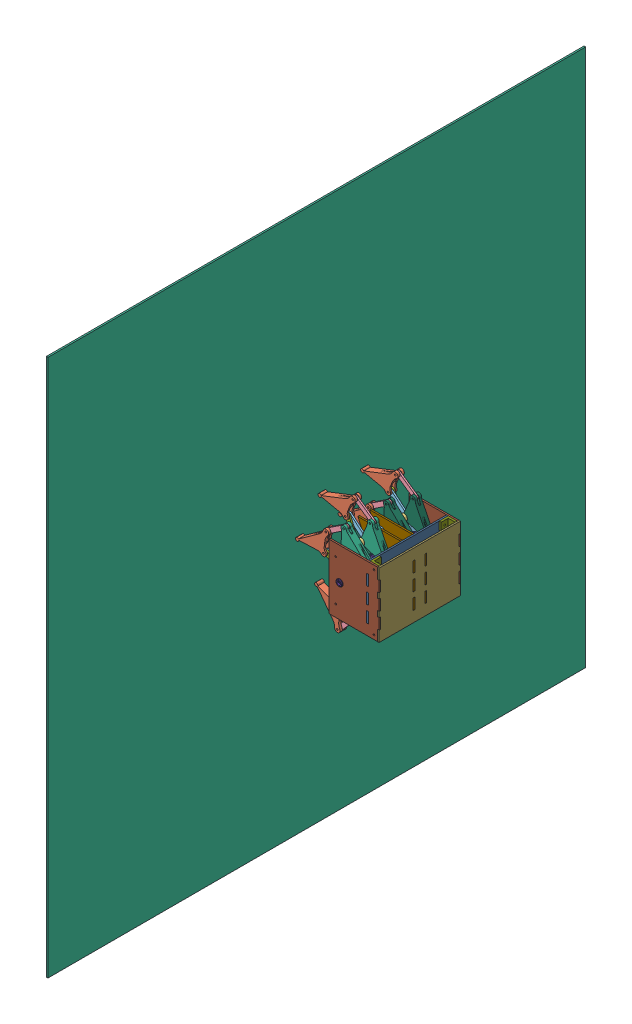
SolidWorks assembly Assemblage marcheur.SLDASM, configuration Défaut (file format 15000). Lengths in mm.
Overall size (169.95 218.78 155.6).
76 component instances, 24 part files, 188 mates.
Components (placement in the parent):
- tt motor-1: tt motor.SLDPRT [Défaut] at (-73 -18.3419 79.6) x (0.906308 0.422618 0) z (0 0 1) size (22.5 70.2 36.8)
- piece triengle bas-pied imp-1: piece triengle bas-pied imp.SLDPRT [Défaut] at (-97.5738 79.1089 85.8) x (0.931902 0.362711 0) z (0 0 1) size (73.7 37.03 12)
- piece vilbrequin 1 imp-1: piece vilbrequin 1 imp.SLDPRT [Défaut] at (-73 -18.3419 88.6) x (-0.413136 -0.910669 0) z (0 0 -1) size (12 27 23.4)
- piece jambe intertriengle 1 decoupe 3mm-1: piece jambe intertriengle 1 decoupe 3mm.SLDPRT [Défaut] at (-65.2336 56.6039 90.3) x (0.820817 -0.571192 0) z (0 0 1) size (47.4 8 3)
- piece jambe intertriengle 2 decoupe 3mm-1: piece jambe intertriengle 2 decoupe 3mm.SLDPRT [Défaut] at (-80.8 19.6581 88.7) x (0.766103 -0.642717 0) z (0 0 1) size (47.3 8 3)
- piece triengle haut imp-1: piece triengle haut imp.SLDPRT [Défaut] at (-40.3341 6.6675 85.8) x (0.95214 -0.305662 0) z (0 0 1) size (52.5 49.94 12)
- piece jambe vilbrequin bas decoupe 3mm-1: piece jambe vilbrequin bas decoupe 3mm.SLDPRT [Défaut] at (-86.66 -12.1449 91.9) x (0.391094 -0.920351 0) z (0 0 1) size (73.5 15 3)
- piece jambe vilbrequin haut decoupe 3mm-1: piece jambe vilbrequin haut decoupe 3mm.SLDPRT [Défaut] at (-86.66 -12.1449 88.8) x (-0.92652 -0.376246 0) z (0 0 1) size (61.5 15 3)
- piece chassie decoupe 3mm-1: piece chassie decoupe 3mm.SLDPRT [Défaut] at (0 -18.3419 60.8) x (0 1 0) z (0 0 -1) size (120 103 3)
- piece chassie decoupe 3mm-2: piece chassie decoupe 3mm.SLDPRT [Défaut] at (0 -18.3419 82.6) x (0 1 0) z (0 0 -1) size (120 103 3)
- piece dessou decoupe 3mm-1: piece dessou decoupe 3mm.SLDPRT [Défaut] at (-20 -18.3419 -5.6) x (0 1 0) z (-1 0 0) size (120 151.6 3)
- piece flac decoupe 3mm-1: piece flac decoupe 3mm.SLDPRT [Défaut] at (0 -18.3419 -5.6) x (0 -1 0) z (0 0 1) size (120 93 3)
- piece flac decoupe 3mm-2: piece flac decoupe 3mm.SLDPRT [Défaut] at (0 -18.3419 143) x (0 -1 0) z (0 0 1) size (120 93 3)
- piece dessus decoupe 3mm-1: piece dessus decoupe 3mm.SLDPRT [Défaut] at (-3 -18.3419 -2.6) x (0 -1 0) z (1 0 0) size (120 151.6 3)
- piece vilbrequin 1 imp-2: piece vilbrequin 1 imp.SLDPRT [Défaut] at (-73 -18.3419 51.8) x (-0.413136 -0.910669 0) z (0 0 1) size (12 27 23.4)
- piece vilbrequin 2 imp-1: piece vilbrequin 2 imp.SLDPRT [Défaut] at (-59.34 -24.5389 45.3) x (0.351809 -0.936072 0) z (0 0 -1) size (15 36.24 27)
- piece vilbrequin 2 imp-2: piece vilbrequin 2 imp.SLDPRT [Défaut] at (-79.2221 -32.0114 27.3) x (-0.936072 -0.351809 0) z (0 0 -1) size (15 36.24 27)
- piece vilbrequin 3 imp-1: piece vilbrequin 3 imp.SLDPRT [Défaut] at (-86.6945 -12.1292 9.3) x (0.351809 -0.936072 0) z (0 0 -1) size (25.61 25.61 14.9)
- piece vilbrequin 2 imp-5: piece vilbrequin 2 imp.SLDPRT [Défaut] at (-86.66 -12.1449 95.1) x (-0.936072 -0.351809 0) z (0 0 1) size (15 36.24 27)
- piece vilbrequin 2 imp-6: piece vilbrequin 2 imp.SLDPRT [Défaut] at (-79.1876 -32.027 113.1) x (0.351809 -0.936072 0) z (0 0 1) size (15 36.24 27)
- piece vilbrequin 3 imp-3: piece vilbrequin 3 imp.SLDPRT [Défaut] at (-59.3055 -24.5546 131.1) x (-0.936072 -0.351809 0) z (0 0 1) size (25.61 25.61 14.9)
- piece jambe vilbrequin bas decoupe 3mm-5: piece jambe vilbrequin bas decoupe 3mm.SLDPRT [Défaut] at (-79.1876 -32.027 106.7) x (0.351073 0.936348 0) z (0 0 1) size (73.5 15 3)
- piece jambe vilbrequin haut decoupe 3mm-5: piece jambe vilbrequin haut decoupe 3mm.SLDPRT [Défaut] at (-79.1876 -32.027 109.9) x (-0.812188 0.583395 0) z (0 0 1) size (61.5 15 3)
- piece triengle haut imp-5: piece triengle haut imp.SLDPRT [Défaut] at (-38.5782 -61.1968 115.9) x (0.993454 -0.114233 0) z (0 0 -1) size (52.5 49.94 12)
- piece jambe intertriengle 2 decoupe 3mm-5: piece jambe intertriengle 2 decoupe 3mm.SLDPRT [Défaut] at (-80.8 -56.3419 109.9) x (0.512829 0.858491 0) z (0 0 1) size (47.3 8 3)
- piece jambe intertriengle 1 decoupe 3mm-5: piece jambe intertriengle 1 decoupe 3mm.SLDPRT [Défaut] at (-81.8566 -96.4192 108.4) x (0.656076 0.754694 0) z (0 0 1) size (47.4 8 3)
- piece triengle bas-pied imp-5: piece triengle bas-pied imp.SLDPRT [Défaut] at (-107.706 -126.1542 115.9) x (0.599404 -0.800446 0) z (0 0 -1) size (73.7 37.03 12)
- piece jambe vilbrequin haut decoupe 3mm-6: piece jambe vilbrequin haut decoupe 3mm.SLDPRT [Défaut] at (-59.3055 -24.5546 124.8) x (-0.419788 -0.907622 0) z (0 0 1) size (61.5 15 3)
- piece jambe vilbrequin bas decoupe 3mm-6: piece jambe vilbrequin bas decoupe 3mm.SLDPRT [Défaut] at (-59.3055 -24.5546 127.9) x (0.908084 -0.418787 0) z (0 0 1) size (73.5 15 3)
- piece triengle haut imp-6: piece triengle haut imp.SLDPRT [Défaut] at (-38.3161 20.8265 121.8) x (0.999622 0.027492 0) z (0 0 1) size (52.5 49.94 12)
- piece jambe intertriengle 2 decoupe 3mm-6: piece jambe intertriengle 2 decoupe 3mm.SLDPRT [Défaut] at (-80.8 19.6581 124.8) x (0.885666 0.464323 0) z (0 0 1) size (47.3 8 3)
- piece jambe intertriengle 1 decoupe 3mm-6: piece jambe intertriengle 1 decoupe 3mm.SLDPRT [Défaut] at (-78.3708 59.6757 126.3) x (0.832392 0.554187 0) z (0 0 1) size (47.4 8 3)
- piece triengle bas-pied imp-6: piece triengle bas-pied imp.SLDPRT [Défaut] at (-111.1671 37.8407 121.9) x (0.812864 0.582454 0) z (0 0 1) size (73.7 37.03 12)
- piece jambe vilbrequin haut decoupe 3mm-7: piece jambe vilbrequin haut decoupe 3mm.SLDPRT [Défaut] at (-59.34 -24.5389 48.6) x (-0.420478 -0.907303 0) z (0 0 1) size (61.5 15 3)
- piece jambe vilbrequin bas decoupe 3mm-7: piece jambe vilbrequin bas decoupe 3mm.SLDPRT [Défaut] at (-59.34 -24.5389 45.5) x (0.907885 -0.419218 0) z (0 0 1) size (73.5 15 3)
- piece jambe intertriengle 2 decoupe 3mm-7: piece jambe intertriengle 2 decoupe 3mm.SLDPRT [Défaut] at (-80.8 19.6581 48.6) x (0.886231 0.463244 0) z (0 0 1) size (47.3 8 3)
- piece jambe intertriengle 1 decoupe 3mm-7: piece jambe intertriengle 1 decoupe 3mm.SLDPRT [Défaut] at (-78.3705 59.6756 47.1) x (0.83312 0.553092 0) z (0 0 1) size (47.4 8 3)
- piece triengle haut 2 imp-1: piece triengle haut 2 imp.SLDPRT [Défaut] at (-38.3161 20.8262 54.6) x (0.999622 0.027484 0) z (0 0 1) size (52.5 49.94 12)
- piece triengle bas-pied imp-7: piece triengle bas-pied imp.SLDPRT [Défaut] at (-111.1955 37.8838 42.6) x (0.812765 0.582592 0) z (0 0 1) size (73.7 37.03 12)
- piece jambe vilbrequin bas decoupe 3mm-8: piece jambe vilbrequin bas decoupe 3mm.SLDPRT [Défaut] at (-79.2221 -32.0114 30.6) x (0.350714 0.936483 0) z (0 0 1) size (73.5 15 3)
- piece jambe vilbrequin haut decoupe 3mm-8: piece jambe vilbrequin haut decoupe 3mm.SLDPRT [Défaut] at (-79.2221 -32.0114 27.5) x (-0.813051 0.582192 0) z (0 0 1) size (61.5 15 3)
- piece triengle haut 2 imp-2: piece triengle haut 2 imp.SLDPRT [Défaut] at (-38.5696 -61.121 24.5) x (0.993658 -0.112448 0) z (0 0 -1) size (52.5 49.94 12)
- piece jambe intertriengle 2 decoupe 3mm-8: piece jambe intertriengle 2 decoupe 3mm.SLDPRT [Défaut] at (-80.8 -56.3419 27.5) x (0.51314 0.858305 0) z (0 0 1) size (47.3 8 3)
- piece jambe intertriengle 1 decoupe 3mm-8: piece jambe intertriengle 1 decoupe 3mm.SLDPRT [Défaut] at (-81.7847 -96.421 28.9) x (0.655835 0.754905 0) z (0 0 1) size (47.4 8 3)
- piece triengle bas-pied imp-8: piece triengle bas-pied imp.SLDPRT [Défaut] at (-107.6245 -126.1643 36.4) x (0.601482 -0.798887 0) z (0 0 -1) size (73.7 37.03 12)
- piece jambe vilbrequin bas decoupe 3mm-9: piece jambe vilbrequin bas decoupe 3mm.SLDPRT [Défaut] at (-86.6945 -12.1292 9.5) x (0.389899 -0.920857 0) z (0 0 1) size (73.5 15 3)
- piece jambe vilbrequin haut decoupe 3mm-9: piece jambe vilbrequin haut decoupe 3mm.SLDPRT [Défaut] at (-86.6945 -12.1292 12.6) x (-0.926961 -0.375158 0) z (0 0 1) size (61.5 15 3)
- piece triengle haut 2 imp-3: piece triengle haut 2 imp.SLDPRT [Défaut] at (-40.3465 6.6287 18.6) x (0.951847 -0.306574 0) z (0 0 1) size (52.5 49.94 12)
- piece jambe intertriengle 1 decoupe 3mm-9: piece jambe intertriengle 1 decoupe 3mm.SLDPRT [Défaut] at (-65.1982 56.589 11.1) x (0.819932 -0.572461 0) z (0 0 1) size (47.4 8 3)
- piece jambe intertriengle 2 decoupe 3mm-9: piece jambe intertriengle 2 decoupe 3mm.SLDPRT [Défaut] at (-80.8 19.6581 12.6) x (0.765097 -0.643915 0) z (0 0 1) size (47.3 8 3)
- piece triengle bas-pied imp-9: piece triengle bas-pied imp.SLDPRT [Défaut] at (-97.5036 79.144 6.6) x (0.932227 0.361874 0) z (0 0 1) size (73.7 37.03 12)
- piece equerre imp-1: piece equerre imp.SLDPRT [Défaut] at (-20 -63.3419 -2.6) x (1 0 0) z (0 -1 0) size (17 17 15)
- piece rondelle vilbrequin imp-1: piece rondelle vilbrequin imp.SLDPRT [Défaut] at (-73 -18.3419 146) x (0.97894 -0.204148 0) z (0 0 1) size (12 12 2)
- piece equerre imp-2: piece equerre imp.SLDPRT [Défaut] at (-20 41.6581 -2.6) x (1 0 0) z (0 -1 0) size (17 17 15)
- piece equerre imp-4: piece equerre imp.SLDPRT [Défaut] at (-20 26.6581 143) x (1 0 0) z (0 1 0) size (17 17 15)
- piece equerre imp-5: piece equerre imp.SLDPRT [Défaut] at (-20 -78.3419 143) x (1 0 0) z (0 1 0) size (17 17 15)
- piece rondelle vilbrequin imp-2: piece rondelle vilbrequin imp.SLDPRT [Défaut] at (-73.0345 -18.3262 -5.6) x (0.974065 -0.226269 0) z (0 0 -1) size (12 12 2)
- piece rondelle vilbrequin imp-3: piece rondelle vilbrequin imp.SLDPRT [Défaut] at (-86.6945 -12.1292 0.3) x (0.020392 -0.999792 0) z (0 0 -1) size (12 12 2)
- piece rondelle vilbrequin imp-4: piece rondelle vilbrequin imp.SLDPRT [Défaut] at (-79.2221 -32.0114 18.3) x (-0.903222 -0.429173 0) z (0 0 -1) size (12 12 2)
- piece rondelle vilbrequin imp-5: piece rondelle vilbrequin imp.SLDPRT [Défaut] at (-59.34 -24.5389 36.3) x (-0.670502 -0.741908 0) z (0 0 -1) size (12 12 2)
- piece rondelle vilbrequin imp-6: piece rondelle vilbrequin imp.SLDPRT [Défaut] at (-86.66 -12.1449 104.1) x (0.909029 0.416733 0) z (0 0 1) size (12 12 2)
- piece rondelle vilbrequin imp-7: piece rondelle vilbrequin imp.SLDPRT [Défaut] at (-79.1876 -32.027 122.1) x (0.909029 0.416733 0) z (0 0 1) size (12 12 2)
- piece rondelle vilbrequin imp-8: piece rondelle vilbrequin imp.SLDPRT [Défaut] at (-59.3055 -24.5546 140.1) x (0.909029 0.416733 0) z (0 0 1) size (12 12 2)
- pice entretoise jambe avant 3 imp-1: pice entretoise jambe avant 3 imp.SLDPRT [Défaut] at (-80.8 -56.3419 36.6) x (0.937021 0.349273 0) z (0 0 1) size (12 12 21.1)
- piece entretoise jambe ariere courte imp-1: piece entretoise jambe ariere courte imp.SLDPRT [Défaut] at (-80.8 19.6581 82.7) x (-0.986301 -0.164956 0) z (0 0 1) size (12 12 3)
- piece entretoise jambe ariere imp-1: piece entretoise jambe ariere imp.SLDPRT [Défaut] at (-80.8 -56.3419 116) x (0.337899 0.941183 0) z (0 0 1) size (12 12 26.9)
- piece entretoise jambe avant 1 imp-1: piece entretoise jambe avant 1 imp.SLDPRT [Défaut] at (-80.8 19.6581 98) x (0.948551 -0.316623 0) z (0 0 1) size (12 12 23.7)
- piece entretoise jambe avant 2 imp-1: piece entretoise jambe avant 2 imp.SLDPRT [Défaut] at (-80.8 19.6581 -2.5) x (0.62539 -0.780313 0) z (0 0 1) size (12 12 9)
- piece entretoise moteur imp-1: piece entretoise moteur imp.SLDPRT [Défaut] at (-80.8 -56.3419 60.8) x (-0.784159 -0.62056 0) z (0 0 1) size (12 12 18.8)
- piece entretoise moteur imp-2: piece entretoise moteur imp.SLDPRT [Défaut] at (-80.8 19.6581 60.8) x (0.906308 0.422618 0) z (0 0 1) size (12 12 18.8)
- piece entretoise jambe ariere courte imp-2: piece entretoise jambe ariere courte imp.SLDPRT [Défaut] at (-80.8 19.6581 54.7) x (0.964741 0.2632 0) z (0 0 1) size (12 12 3)
- piece entretoise jambe avant 1 imp-2: piece entretoise jambe avant 1 imp.SLDPRT [Défaut] at (-80.8 19.6581 18.7) x (0.661367 -0.750062 0) z (0 0 1) size (12 12 23.7)
- piece entretoise jambe ariere imp-2: piece entretoise jambe ariere imp.SLDPRT [Défaut] at (-80.8 -56.3419 -2.7) x (0.953597 0.301085 0) z (0 0 1) size (12 12 26.9)
- pice entretoise jambe avant 3 imp-2: pice entretoise jambe avant 3 imp.SLDPRT [Défaut] at (-80.8 -56.3419 82.7) x (0.951721 0.306963 0) z (0 0 1) size (12 12 21.1)
- piece entretoise jambe avant 2 imp-2: piece entretoise jambe avant 2 imp.SLDPRT [Défaut] at (-80.8 19.6581 134) x (0.854045 0.520199 0) z (0 0 1) size (12 12 9)
- plancher des vaches-1: plancher des vaches.SLDPRT [Défaut] at (-167.5 -478.3419 -405.6) x (0 0 1) z (-1 0 0) size (1000 1000 3) (hidden)
Mates (geometry in assembly coordinates):
- Coaxiale1: concentric anti-aligned: circle of tt motor-1; circle of piece vilbrequin 1 imp-1
- Coïncidente1: coincident anti-aligned: plane of tt motor-1 through (-71.0031 -22.6242 80.7) normal (0 0 1); plane of piece vilbrequin 1 imp-1 through (-73 -18.3419 80.7) normal (0 0 -1)
- Coaxiale2: concentric anti-aligned: cylinder of piece vilbrequin 1 imp-1 through (-86.66 -12.1449 95.1) axis (0 0 -1) radius 4.8; circle of piece jambe vilbrequin haut decoupe 3mm-1
- Distance2: distance = 0.2 mm anti-aligned: plane of piece vilbrequin 1 imp-1 through (-73 -18.3419 88.6) normal (0 0 1); plane of piece jambe vilbrequin haut decoupe 3mm-1 through (-86.66 -12.1449 88.8) normal (0 0 -1)
- Coaxiale3: concentric anti-aligned: cylinder of piece vilbrequin 1 imp-1 through (-86.66 -12.1449 95.1) axis (0 0 -1) radius 4.8; circle of piece jambe vilbrequin bas decoupe 3mm-1
- Distance1: distance = 0.1 mm anti-aligned: plane of piece jambe vilbrequin bas decoupe 3mm-1 through (-86.66 -12.1449 91.9) normal (0 0 -1); plane of piece jambe vilbrequin haut decoupe 3mm-1 through (-86.66 -12.1449 91.8) normal (0 0 1)
- Coaxiale14: concentric aligned: cylinder of piece triengle haut imp-1 through (-40.3341 6.6675 97.8) axis (0 0 -1) radius 1.5; cylinder of piece jambe vilbrequin haut decoupe 3mm-1 through (-40.3341 6.6675 91.8) axis (0 0 -1) radius 1.75
- Distance9: distance = 0.1 mm anti-aligned: plane of piece jambe vilbrequin haut decoupe 3mm-1 through (-86.66 -12.1449 91.8) normal (0 0 1); plane of piece triengle haut imp-1 through (-40.3341 6.6675 91.9) normal (0 0 -1)
- Coaxiale15: concentric aligned: cylinder of piece jambe intertriengle 1 decoupe 3mm-1 through (-65.2336 56.6039 93.3) axis (0 0 -1) radius 1.75; cylinder of piece triengle haut imp-1 through (-65.2336 56.6039 97.8) axis (0 0 -1) radius 1.5
- Distance10: distance = 0.1 mm anti-aligned: plane of piece jambe intertriengle 1 decoupe 3mm-1 through (-65.2336 56.6039 90.3) normal (0 0 -1); plane of piece triengle haut imp-1 through (-40.3341 6.6675 90.2) normal (0 0 1)
- Coaxiale16: concentric aligned: cylinder of piece triengle bas-pied imp-1 through (-97.5738 79.1089 97.8) axis (0 0 -1) radius 1.5; cylinder of piece jambe intertriengle 1 decoupe 3mm-1 through (-97.5738 79.1089 93.3) axis (0 0 -1) radius 1.75
- Distance11: distance = 0.1 mm anti-aligned: plane of piece triengle bas-pied imp-1 through (-97.5738 79.1089 90.2) normal (0 0 1); plane of piece jambe intertriengle 1 decoupe 3mm-1 through (-65.2336 56.6039 90.3) normal (0 0 -1)
- Coaxiale17: concentric aligned: cylinder of piece triengle bas-pied imp-1 through (-110.9079 44.9169 97.8) axis (0 0 -1) radius 1.5; cylinder of piece jambe intertriengle 2 decoupe 3mm-1 through (-110.9079 44.9169 91.7) axis (0 0 -1) radius 1.75
- Distance12: distance = 0.1 mm anti-aligned: plane of piece jambe intertriengle 2 decoupe 3mm-1 through (-80.8 19.6581 88.7) normal (0 0 -1); plane of piece triengle bas-pied imp-1 through (-110.9079 44.9169 88.6) normal (0 0 1)
- Coaxiale18: concentric aligned: cylinder of piece jambe intertriengle 2 decoupe 3mm-1 through (-80.8 19.6581 91.7) axis (0 0 -1) radius 1.75; cylinder of piece triengle haut imp-1 through (-80.8 19.6581 97.8) axis (0 0 -1) radius 1.5
- Coaxiale20: concentric aligned: cylinder of piece triengle bas-pied imp-1 through (-110.9079 44.9169 97.8) axis (0 0 -1) radius 1.5; cylinder of piece jambe vilbrequin bas decoupe 3mm-1 through (-110.9079 44.9169 94.9) axis (0 0 -1) radius 1.75
- Coaxiale23: concentric anti-aligned: cylinder of tt motor-1 through (-56.3639 -33.3139 70.2) axis (0 0 -1) radius 1.5; cylinder of piece chassie decoupe 3mm-1 through (-56.3639 -33.3139 57.8) axis (0 0 1) radius 1.5
- Coaxiale24: concentric anti-aligned: cylinder of tt motor-1 through (-72.2243 -40.7097 70.2) axis (0 0 -1) radius 1.5; cylinder of piece chassie decoupe 3mm-1 through (-72.2243 -40.7097 57.8) axis (0 0 1) radius 1.5
- Coïncidente3: coincident anti-aligned: plane of tt motor-1 through (-71.0031 -22.6242 60.8) normal (0 0 -1); plane of piece chassie decoupe 3mm-1 through (0 -18.3419 60.8) normal (0 0 1)
- Coaxiale25: concentric anti-aligned: cylinder of tt motor-1 through (-72.2243 -40.7097 70.2) axis (0 0 -1) radius 1.5; cylinder of piece chassie decoupe 3mm-2 through (-72.2243 -40.7097 79.6) axis (0 0 1) radius 1.5
- Coaxiale26: concentric anti-aligned: cylinder of tt motor-1 through (-56.3639 -33.3139 70.2) axis (0 0 -1) radius 1.5; cylinder of piece chassie decoupe 3mm-2 through (-56.3639 -33.3139 79.6) axis (0 0 1) radius 1.5
- Coïncidente10: coincident anti-aligned: plane of tt motor-1 through (-71.0031 -22.6242 79.6) normal (0 0 1); plane of piece chassie decoupe 3mm-2 through (0 -18.3419 79.6) normal (0 0 -1)
- Coaxiale36: concentric aligned: circle of tt motor-1; circle of piece vilbrequin 1 imp-2
- Coïncidente17: coincident aligned: plane of tt motor-1 through (-73 -18.3419 51.8) normal (0 0 -1); plane of piece vilbrequin 1 imp-2 through (-73 -18.3419 51.8) normal (0 0 -1)
- Coïncidente20: coincident aligned: plane of piece vilbrequin 1 imp-1 through (-8.9232 10.6711 80.7) normal (0.352753 0.935717 0); plane of piece vilbrequin 1 imp-2 through (-4.7386 9.0935 59.7) normal (0.352753 0.935717 0)
- Coaxiale38: concentric aligned: cylinder of piece vilbrequin 1 imp-2 through (-59.34 -24.5389 45.3) axis (0 0 1) radius 4.8; cylinder of piece vilbrequin 2 imp-1 through (-59.34 -24.5389 36.3) axis (0 0 1) radius 7.5
- Parallèle3: parallel anti-aligned: plane of piece vilbrequin 1 imp-2 through (-70.3239 -25.4622 36.3) normal (-0.351809 0.936072 0); plane of piece vilbrequin 2 imp-1 through (-60.4658 -21.5435 36.3) normal (0.351809 -0.936072 0)
- Coïncidente25: coincident anti-aligned: plane of piece vilbrequin 1 imp-2 through (-59.34 -24.5389 45.3) normal (0 0 -1); plane of piece vilbrequin 2 imp-1 through (-59.34 -24.5389 45.3) normal (0 0 1)
- Coaxiale39: concentric aligned: cylinder of piece vilbrequin 2 imp-1 through (-79.2221 -32.0114 27.3) axis (0 0 1) radius 4.75; cylinder of piece vilbrequin 2 imp-2 through (-79.2221 -32.0114 18.3) axis (0 0 1) radius 7.5
- Parallèle4: parallel anti-aligned: plane of piece vilbrequin 2 imp-1 through (-82.0303 -33.0668 18.3) normal (-0.936072 -0.351809 0); plane of piece vilbrequin 2 imp-2 through (-82.2176 -33.1372 18.3) normal (0.936072 0.351809 0)
- Coïncidente27: coincident anti-aligned: plane of piece vilbrequin 2 imp-1 through (-79.2221 -32.0114 27.3) normal (0 0 -1); plane of piece vilbrequin 2 imp-2 through (-79.2221 -32.0114 27.3) normal (0 0 1)
- Coaxiale40: concentric aligned: cylinder of piece vilbrequin 2 imp-2 through (-86.6945 -12.1292 9.3) axis (0 0 1) radius 4.75; cylinder of piece vilbrequin 3 imp-1 through (-86.6945 -12.1292 0.3) axis (0 0 1) radius 5
- Parallèle6: parallel anti-aligned: plane of piece vilbrequin 2 imp-2 through (-85.6391 -14.9374 0.3) normal (0.351809 -0.936072 0); plane of piece vilbrequin 3 imp-1 through (-85.5688 -15.1246 0.3) normal (-0.351809 0.936072 0)
- Coïncidente30: coincident anti-aligned: plane of piece vilbrequin 2 imp-2 through (-86.6945 -12.1292 9.3) normal (0 0 -1); plane of piece vilbrequin 3 imp-1 through (-86.6945 -12.1292 9.3) normal (0 0 1)
- Coaxiale41: concentric aligned: cylinder of piece vilbrequin 1 imp-1 through (-86.66 -12.1449 95.1) axis (0 0 -1) radius 4.8; cylinder of piece vilbrequin 2 imp-5 through (-86.66 -12.1449 104.1) axis (0 0 -1) radius 7.5
- Coïncidente31: coincident anti-aligned: plane of piece vilbrequin 1 imp-1 through (-86.66 -12.1449 95.1) normal (0 0 1); plane of piece vilbrequin 2 imp-5 through (-86.66 -12.1449 95.1) normal (0 0 -1)
- Parallèle7: parallel anti-aligned: plane of piece vilbrequin 1 imp-1 through (-85.7368 -23.1288 104.1) normal (-0.936072 -0.351809 0); plane of piece vilbrequin 2 imp-5 through (-89.6555 -13.2706 104.1) normal (0.936072 0.351809 0)
- Coaxiale42: concentric aligned: cylinder of piece vilbrequin 2 imp-5 through (-79.1876 -32.027 113.1) axis (0 0 -1) radius 4.75; cylinder of piece vilbrequin 2 imp-6 through (-79.1876 -32.027 122.1) axis (0 0 -1) radius 7.5
- Coïncidente33: coincident anti-aligned: plane of piece vilbrequin 2 imp-5 through (-79.1876 -32.027 113.1) normal (0 0 1); plane of piece vilbrequin 2 imp-6 through (-79.1876 -32.027 113.1) normal (0 0 -1)
- Coaxiale50: concentric aligned: cylinder of piece vilbrequin 2 imp-6 through (-59.3055 -24.5546 131.1) axis (0 0 -1) radius 4.75; cylinder of piece vilbrequin 3 imp-3 through (-59.3055 -24.5546 140.1) axis (0 0 -1) radius 7.5
- Parallèle10: parallel anti-aligned: plane of piece vilbrequin 2 imp-5 through (-80.243 -29.2188 122.1) normal (-0.351809 0.936072 0); plane of piece vilbrequin 2 imp-6 through (-80.3134 -29.0316 122.1) normal (0.351809 -0.936072 0)
- Parallèle11: parallel anti-aligned: plane of piece vilbrequin 3 imp-3 through (-62.3009 -25.6804 140.1) normal (0.936072 0.351809 0); plane of piece vilbrequin 2 imp-6 through (-62.1137 -25.61 140.1) normal (-0.936072 -0.351809 0)
- Coïncidente42: coincident anti-aligned: plane of piece vilbrequin 2 imp-6 through (-59.3055 -24.5546 131.1) normal (0 0 1); plane of piece vilbrequin 3 imp-3 through (-59.3055 -24.5546 131.1) normal (0 0 -1)
- Coaxiale51: concentric anti-aligned: cylinder of piece vilbrequin 2 imp-5 through (-79.1876 -32.027 113.1) axis (0 0 -1) radius 4.75; circle of piece jambe vilbrequin bas decoupe 3mm-5
- Coaxiale52: concentric aligned: cylinder of piece vilbrequin 2 imp-5 through (-79.1876 -32.027 113.1) axis (0 0 -1) radius 4.75; cylinder of piece jambe vilbrequin haut decoupe 3mm-5 through (-79.1876 -32.027 112.9) axis (0 0 -1) radius 5
- Distance18: distance = 0.2 mm anti-aligned: plane of piece jambe vilbrequin haut decoupe 3mm-5 through (-79.1876 -32.027 112.9) normal (0 0 1); plane of piece vilbrequin 2 imp-6 through (-79.1876 -32.027 113.1) normal (0 0 -1)
- Distance19: distance = 0.1 mm anti-aligned: plane of piece jambe vilbrequin bas decoupe 3mm-5 through (-79.1876 -32.027 106.7) normal (0 0 -1); plane of piece vilbrequin 2 imp-5 through (-79.1876 -32.027 106.6) normal (0 0 1)
- Coaxiale53: concentric anti-aligned: cylinder of piece jambe vilbrequin haut decoupe 3mm-5 through (-38.5782 -61.1968 112.9) axis (0 0 -1) radius 1.75; cylinder of piece triengle haut imp-5 through (-38.5782 -61.1968 103.9) axis (0 0 1) radius 1.5
- Distance20: distance = 0.1 mm anti-aligned: plane of piece jambe vilbrequin haut decoupe 3mm-5 through (-79.1876 -32.027 109.9) normal (0 0 -1); plane of piece triengle haut imp-5 through (-38.5782 -61.1968 109.8) normal (0 0 1)
- Coaxiale54: concentric anti-aligned: cylinder of piece triengle haut imp-5 through (-80.8 -56.3419 103.9) axis (0 0 1) radius 1.5; cylinder of piece jambe intertriengle 2 decoupe 3mm-5 through (-80.8 -56.3419 112.9) axis (0 0 -1) radius 1.75
- Distance21: distance = 0.1 mm anti-aligned: plane of piece jambe intertriengle 2 decoupe 3mm-5 through (-80.8 -56.3419 109.9) normal (0 0 -1); plane of piece triengle haut imp-5 through (-80.8 -56.3419 109.8) normal (0 0 1)
- Coaxiale55: concentric anti-aligned: cylinder of piece triengle haut imp-5 through (-81.8566 -96.4192 103.9) axis (0 0 1) radius 1.5; cylinder of piece jambe intertriengle 1 decoupe 3mm-5 through (-81.8566 -96.4192 111.4) axis (0 0 -1) radius 1.75
- Distance22: distance = 0.1 mm anti-aligned: plane of piece jambe intertriengle 1 decoupe 3mm-5 through (-81.8566 -96.4192 108.4) normal (0 0 -1); plane of piece triengle haut imp-5 through (-38.5782 -61.1968 108.3) normal (0 0 1)
- Coaxiale57: concentric anti-aligned: cylinder of piece jambe intertriengle 1 decoupe 3mm-5 through (-107.706 -126.1542 111.4) axis (0 0 -1) radius 1.75; cylinder of piece triengle bas-pied imp-5 through (-107.706 -126.1542 103.9) axis (0 0 1) radius 1.5
- Distance23: distance = 0.1 mm anti-aligned: plane of piece triengle bas-pied imp-5 through (-107.706 -126.1542 108.3) normal (0 0 1); plane of piece jambe intertriengle 1 decoupe 3mm-5 through (-81.8566 -96.4192 108.4) normal (0 0 -1)
- Coaxiale58: concentric anti-aligned: cylinder of piece jambe intertriengle 2 decoupe 3mm-5 through (-100.9542 -90.0806 112.9) axis (0 0 -1) radius 1.75; cylinder of piece triengle bas-pied imp-5 through (-100.9542 -90.0806 103.9) axis (0 0 1) radius 1.5
- Coaxiale59: concentric anti-aligned: cylinder of piece jambe vilbrequin bas decoupe 3mm-5 through (-100.9542 -90.0806 109.7) axis (0 0 -1) radius 1.75; cylinder of piece triengle bas-pied imp-5 through (-100.9542 -90.0806 103.9) axis (0 0 1) radius 1.5
- Coïncidente50: coincident aligned: plane of piece vilbrequin 1 imp-1 through (-75.8626 -19.2394 80.7) normal (0.413136 0.910669 0); plane of piece vilbrequin 1 imp-2 through (-71.79 -21.087 59.7) normal (0.413136 0.910669 0)
- Coaxiale60: concentric aligned: cylinder of piece vilbrequin 2 imp-6 through (-59.3055 -24.5546 131.1) axis (0 0 -1) radius 4.75; cylinder of piece jambe vilbrequin bas decoupe 3mm-6 through (-59.3055 -24.5546 130.9) axis (0 0 -1) radius 5
- Distance24: distance = 0.2 mm anti-aligned: plane of piece jambe vilbrequin bas decoupe 3mm-6 through (-59.3055 -24.5546 130.9) normal (0 0 1); plane of piece vilbrequin 3 imp-3 through (-59.3055 -24.5546 131.1) normal (0 0 -1)
- Coaxiale61: concentric aligned: cylinder of piece vilbrequin 2 imp-6 through (-59.3055 -24.5546 131.1) axis (0 0 -1) radius 4.75; cylinder of piece jambe vilbrequin haut decoupe 3mm-6 through (-59.3055 -24.5546 127.8) axis (0 0 -1) radius 5
- Distance25: distance = 0.2 mm anti-aligned: plane of piece jambe vilbrequin haut decoupe 3mm-6 through (-59.3055 -24.5546 124.8) normal (0 0 -1); plane of piece vilbrequin 2 imp-6 through (-59.3055 -24.5546 124.6) normal (0 0 1)
- Coaxiale62: concentric aligned: cylinder of piece jambe vilbrequin haut decoupe 3mm-6 through (-38.3161 20.8265 127.8) axis (0 0 -1) radius 1.75; cylinder of piece triengle haut imp-6 through (-38.3161 20.8265 133.8) axis (0 0 -1) radius 1.5
- Distance26: distance = 0.1 mm anti-aligned: plane of piece jambe vilbrequin haut decoupe 3mm-6 through (-59.3055 -24.5546 124.8) normal (0 0 -1); plane of piece triengle haut imp-6 through (-38.3161 20.8265 124.7) normal (0 0 1)
- Coaxiale63: concentric aligned: cylinder of piece triengle haut imp-6 through (-80.8 19.6581 133.8) axis (0 0 -1) radius 1.5; cylinder of piece jambe intertriengle 2 decoupe 3mm-6 through (-80.8 19.6581 127.8) axis (0 0 -1) radius 1.75
- Distance27: distance = 0.1 mm anti-aligned: plane of piece jambe intertriengle 2 decoupe 3mm-6 through (-80.8 19.6581 127.8) normal (0 0 1); plane of piece triengle haut imp-6 through (-80.8 19.6581 127.9) normal (0 0 -1)
- Coaxiale64: concentric aligned: cylinder of piece triengle haut imp-6 through (-78.3708 59.6757 133.8) axis (0 0 -1) radius 1.5; cylinder of piece jambe intertriengle 1 decoupe 3mm-6 through (-78.3708 59.6757 129.3) axis (0 0 -1) radius 1.75
- Distance28: distance = 0.1 mm anti-aligned: plane of piece jambe intertriengle 1 decoupe 3mm-6 through (-78.3708 59.6757 129.3) normal (0 0 1); plane of piece triengle haut imp-6 through (-38.3161 20.8265 129.4) normal (0 0 -1)
- Coaxiale65: concentric aligned: cylinder of piece jambe intertriengle 2 decoupe 3mm-6 through (-115.6067 1.4102 127.8) axis (0 0 -1) radius 1.75; cylinder of piece triengle bas-pied imp-6 through (-115.6067 1.4102 133.9) axis (0 0 -1) radius 1.5
- Distance29: distance = 0.1 mm anti-aligned: plane of piece jambe intertriengle 2 decoupe 3mm-6 through (-80.8 19.6581 124.8) normal (0 0 -1); plane of piece triengle bas-pied imp-6 through (-115.6067 1.4102 124.7) normal (0 0 1)
- Coaxiale67: concentric aligned: cylinder of piece jambe intertriengle 1 decoupe 3mm-6 through (-111.1671 37.8407 129.3) axis (0 0 -1) radius 1.75; cylinder of piece triengle bas-pied imp-6 through (-111.1671 37.8407 133.9) axis (0 0 -1) radius 1.5
- Coaxiale68: concentric aligned: cylinder of piece jambe vilbrequin bas decoupe 3mm-6 through (-115.6067 1.4102 130.9) axis (0 0 -1) radius 1.75; cylinder of piece triengle bas-pied imp-6 through (-115.6067 1.4102 133.9) axis (0 0 -1) radius 1.5
- Coaxiale71: concentric aligned: cylinder of piece flac decoupe 3mm-1 through (-80.8 19.6581 -2.6) axis (0 0 -1) radius 1.5; cylinder of piece triengle haut imp-6 through (-80.8 19.6581 133.8) axis (0 0 -1) radius 1.5
- Coaxiale72: concentric anti-aligned: cylinder of piece vilbrequin 1 imp-2 through (-59.34 -24.5389 45.3) axis (0 0 1) radius 4.8; cylinder of piece jambe vilbrequin haut decoupe 3mm-7 through (-59.34 -24.5389 51.6) axis (0 0 -1) radius 7.5
- Distance33: distance = 0.2 mm anti-aligned: plane of piece jambe vilbrequin haut decoupe 3mm-7 through (-59.34 -24.5389 51.6) normal (0 0 1); plane of piece vilbrequin 1 imp-2 through (-73 -18.3419 51.8) normal (0 0 -1)
- Coaxiale75: concentric anti-aligned: cylinder of piece vilbrequin 1 imp-2 through (-59.34 -24.5389 45.3) axis (0 0 1) radius 4.8; cylinder of piece jambe vilbrequin bas decoupe 3mm-7 through (-59.34 -24.5389 48.5) axis (0 0 -1) radius 5
- Distance34: distance = 0.1 mm anti-aligned: plane of piece jambe vilbrequin bas decoupe 3mm-7 through (-59.34 -24.5389 48.5) normal (0 0 1); plane of piece jambe vilbrequin haut decoupe 3mm-7 through (-59.34 -24.5389 48.6) normal (0 0 -1)
- Coaxiale76: concentric anti-aligned: cylinder of piece jambe vilbrequin haut decoupe 3mm-7 through (-38.3161 20.8262 51.6) axis (0 0 -1) radius 1.75; cylinder of piece triengle haut 2 imp-1 through (-38.3161 20.8262 42.6) axis (0 0 1) radius 1.5
- Distance35: distance = 0.1 mm anti-aligned: plane of piece jambe vilbrequin haut decoupe 3mm-7 through (-59.34 -24.5389 51.6) normal (0 0 1); plane of piece triengle haut 2 imp-1 through (-38.3161 20.8262 51.7) normal (0 0 -1)
- Coaxiale77: concentric anti-aligned: cylinder of piece jambe intertriengle 2 decoupe 3mm-7 through (-80.8 19.6581 51.6) axis (0 0 -1) radius 1.75; cylinder of piece triengle haut 2 imp-1 through (-80.8 19.6581 42.6) axis (0 0 1) radius 1.5
- Distance36: distance = 0.1 mm anti-aligned: plane of piece jambe intertriengle 2 decoupe 3mm-7 through (-80.8 19.6581 51.6) normal (0 0 1); plane of piece triengle haut 2 imp-1 through (-80.8 19.6581 51.7) normal (0 0 -1)
- Coaxiale78: concentric anti-aligned: cylinder of piece jambe intertriengle 1 decoupe 3mm-7 through (-78.3705 59.6756 50.1) axis (0 0 -1) radius 1.75; cylinder of piece triengle haut 2 imp-1 through (-78.3705 59.6756 42.6) axis (0 0 1) radius 1.5
- Distance37: distance = 0.1 mm anti-aligned: plane of piece jambe intertriengle 1 decoupe 3mm-7 through (-78.3705 59.6756 47.1) normal (0 0 -1); plane of piece triengle haut 2 imp-1 through (-38.3161 20.8262 47) normal (0 0 1)
- Coaxiale79: concentric aligned: cylinder of piece jambe intertriengle 1 decoupe 3mm-7 through (-111.1955 37.8838 50.1) axis (0 0 -1) radius 1.75; cylinder of piece triengle bas-pied imp-7 through (-111.1955 37.8838 54.6) axis (0 0 -1) radius 1.5
- Distance38: distance = 0.1 mm anti-aligned: plane of piece triengle bas-pied imp-7 through (-111.1955 37.8838 50.2) normal (0 0 -1); plane of piece jambe intertriengle 1 decoupe 3mm-7 through (-78.3705 59.6756 50.1) normal (0 0 1)
- Coaxiale80: concentric aligned: cylinder of piece jambe intertriengle 2 decoupe 3mm-7 through (-115.6289 1.4526 51.6) axis (0 0 -1) radius 1.75; cylinder of piece triengle bas-pied imp-7 through (-115.6289 1.4526 54.6) axis (0 0 -1) radius 1.5
- Coaxiale81: concentric aligned: cylinder of piece jambe vilbrequin bas decoupe 3mm-7 through (-115.6289 1.4526 48.5) axis (0 0 -1) radius 1.75; cylinder of piece triengle bas-pied imp-7 through (-115.6289 1.4526 54.6) axis (0 0 -1) radius 1.5
- Coaxiale83: concentric anti-aligned: cylinder of piece vilbrequin 2 imp-1 through (-79.2221 -32.0114 27.3) axis (0 0 1) radius 4.75; cylinder of piece jambe vilbrequin bas decoupe 3mm-8 through (-79.2221 -32.0114 33.6) axis (0 0 -1) radius 5
- Distance40: distance = 0.2 mm anti-aligned: plane of piece jambe vilbrequin bas decoupe 3mm-8 through (-79.2221 -32.0114 33.6) normal (0 0 1); plane of piece vilbrequin 2 imp-1 through (-79.2221 -32.0114 33.8) normal (0 0 -1)
- Coaxiale84: concentric anti-aligned: cylinder of piece vilbrequin 2 imp-1 through (-79.2221 -32.0114 27.3) axis (0 0 1) radius 4.75; cylinder of piece jambe vilbrequin haut decoupe 3mm-8 through (-79.2221 -32.0114 30.5) axis (0 0 -1) radius 5
- Distance41: distance = 0.2 mm anti-aligned: plane of piece jambe vilbrequin haut decoupe 3mm-8 through (-79.2221 -32.0114 27.5) normal (0 0 -1); plane of piece vilbrequin 2 imp-2 through (-79.2221 -32.0114 27.3) normal (0 0 1)
- Coaxiale85: concentric aligned: cylinder of piece jambe vilbrequin haut decoupe 3mm-8 through (-38.5696 -61.121 30.5) axis (0 0 -1) radius 1.75; cylinder of piece triengle haut 2 imp-2 through (-38.5696 -61.121 36.5) axis (0 0 -1) radius 1.5
- Distance42: distance = 0.1 mm anti-aligned: plane of piece triengle haut 2 imp-2 through (-38.5696 -61.121 30.6) normal (0 0 -1); plane of piece jambe vilbrequin haut decoupe 3mm-8 through (-79.2221 -32.0114 30.5) normal (0 0 1)
- Coaxiale86: concentric aligned: cylinder of piece triengle haut 2 imp-2 through (-80.8 -56.3419 36.5) axis (0 0 -1) radius 1.5; cylinder of piece jambe intertriengle 2 decoupe 3mm-8 through (-80.8 -56.3419 30.5) axis (0 0 -1) radius 1.75
- Distance43: distance = 0.1 mm anti-aligned: plane of piece jambe intertriengle 2 decoupe 3mm-8 through (-80.8 -56.3419 27.5) normal (0 0 -1); plane of piece triengle haut 2 imp-2 through (-80.8 -56.3419 27.4) normal (0 0 1)
- Coaxiale87: concentric aligned: cylinder of piece triengle haut 2 imp-2 through (-81.7847 -96.421 36.5) axis (0 0 -1) radius 1.5; cylinder of piece jambe intertriengle 1 decoupe 3mm-8 through (-81.7847 -96.421 31.9) axis (0 0 -1) radius 1.75
- Coïncidente60: coincident anti-aligned: plane of piece triengle haut 2 imp-2 through (-38.5696 -61.121 28.9) normal (0 0 1); plane of piece jambe intertriengle 1 decoupe 3mm-8 through (-81.7847 -96.421 28.9) normal (0 0 -1)
- Coaxiale88: concentric anti-aligned: cylinder of piece jambe intertriengle 1 decoupe 3mm-8 through (-107.6245 -126.1643 31.9) axis (0 0 -1) radius 1.75; cylinder of piece triengle bas-pied imp-8 through (-107.6245 -126.1643 24.4) axis (0 0 1) radius 1.5
- Distance44: distance = 0.1 mm anti-aligned: plane of piece jambe intertriengle 1 decoupe 3mm-8 through (-81.7847 -96.421 28.9) normal (0 0 -1); plane of piece triengle bas-pied imp-8 through (-107.6245 -126.1643 28.8) normal (0 0 1)
- Coaxiale89: concentric anti-aligned: cylinder of piece jambe intertriengle 2 decoupe 3mm-8 through (-100.9664 -90.0733 30.5) axis (0 0 -1) radius 1.75; cylinder of piece triengle bas-pied imp-8 through (-100.9664 -90.0733 24.4) axis (0 0 1) radius 1.5
- Coaxiale90: concentric anti-aligned: cylinder of piece jambe vilbrequin bas decoupe 3mm-8 through (-100.9664 -90.0733 33.6) axis (0 0 -1) radius 1.75; cylinder of piece triengle bas-pied imp-8 through (-100.9664 -90.0733 24.4) axis (0 0 1) radius 1.5
- Coaxiale91: concentric aligned: cylinder of piece flac decoupe 3mm-1 through (-80.8 -56.3419 -2.6) axis (0 0 -1) radius 1.5; cylinder of piece triengle haut 2 imp-2 through (-80.8 -56.3419 36.5) axis (0 0 -1) radius 1.5
- Coaxiale92: concentric anti-aligned: cylinder of piece vilbrequin 2 imp-2 through (-86.6945 -12.1292 9.3) axis (0 0 1) radius 4.75; cylinder of piece jambe vilbrequin bas decoupe 3mm-9 through (-86.6945 -12.1292 12.5) axis (0 0 -1) radius 5
- Distance45: distance = 0.2 mm anti-aligned: plane of piece vilbrequin 3 imp-1 through (-86.6945 -12.1292 9.3) normal (0 0 1); plane of piece jambe vilbrequin bas decoupe 3mm-9 through (-86.6945 -12.1292 9.5) normal (0 0 -1)
- Coaxiale93: concentric aligned: cylinder of piece vilbrequin 2 imp-2 through (-86.6945 -12.1292 9.3) axis (0 0 1) radius 4.75; circle of piece jambe vilbrequin haut decoupe 3mm-9
- Distance46: distance = 0.2 mm anti-aligned: plane of piece jambe vilbrequin haut decoupe 3mm-9 through (-86.6945 -12.1292 15.6) normal (0 0 1); plane of piece vilbrequin 2 imp-2 through (-86.6945 -12.1292 15.8) normal (0 0 -1)
- Coaxiale94: concentric anti-aligned: cylinder of piece jambe vilbrequin haut decoupe 3mm-9 through (-40.3465 6.6287 15.6) axis (0 0 -1) radius 1.75; cylinder of piece triengle haut 2 imp-3 through (-40.3465 6.6287 6.6) axis (0 0 1) radius 1.5
- Distance62: distance = 0.1 mm anti-aligned: plane of piece jambe vilbrequin haut decoupe 3mm-9 through (-86.6945 -12.1292 12.6) normal (0 0 -1); plane of piece triengle haut 2 imp-3 through (-40.3465 6.6287 12.5) normal (0 0 1)
- Coaxiale95: concentric anti-aligned: cylinder of piece triengle haut 2 imp-3 through (-65.1982 56.589 6.6) axis (0 0 1) radius 1.5; cylinder of piece jambe intertriengle 1 decoupe 3mm-9 through (-65.1982 56.589 14.1) axis (0 0 -1) radius 1.75
- Distance47: distance = 0.1 mm anti-aligned: plane of piece jambe intertriengle 1 decoupe 3mm-9 through (-65.1982 56.589 11.1) normal (0 0 -1); plane of piece triengle haut 2 imp-3 through (-40.3465 6.6287 11) normal (0 0 1)
- Coaxiale96: concentric anti-aligned: cylinder of piece triengle haut 2 imp-3 through (-80.8 19.6581 6.6) axis (0 0 1) radius 1.5; cylinder of piece jambe intertriengle 2 decoupe 3mm-9 through (-80.8 19.6581 15.6) axis (0 0 -1) radius 1.75
- Distance48: distance = 0.1 mm anti-aligned: plane of piece jambe intertriengle 2 decoupe 3mm-9 through (-80.8 19.6581 15.6) normal (0 0 1); plane of piece triengle haut 2 imp-3 through (-80.8 19.6581 15.7) normal (0 0 -1)
- Distance51: distance = 0.1 mm anti-aligned: plane of piece jambe intertriengle 1 decoupe 3mm-9 through (-65.1982 56.589 14.1) normal (0 0 1); plane of piece triengle bas-pied imp-9 through (-97.5036 79.144 14.2) normal (0 0 -1)
- Coaxiale99: concentric aligned: cylinder of piece jambe intertriengle 2 decoupe 3mm-9 through (-110.8683 44.964 15.6) axis (0 0 -1) radius 1.75; cylinder of piece triengle bas-pied imp-9 through (-110.8683 44.964 18.6) axis (0 0 -1) radius 1.5
- Coaxiale100: concentric aligned: cylinder of piece jambe vilbrequin bas decoupe 3mm-9 through (-110.8683 44.964 12.5) axis (0 0 -1) radius 1.75; cylinder of piece triengle bas-pied imp-9 through (-110.8683 44.964 18.6) axis (0 0 -1) radius 1.5
- Coaxiale101: concentric anti-aligned: cylinder of piece flac decoupe 3mm-1 through (-80.8 19.6581 -2.6) axis (0 0 -1) radius 1.5; cylinder of piece triengle haut 2 imp-3 through (-80.8 19.6581 6.6) axis (0 0 1) radius 1.5
- Coïncidente71: coincident aligned: cylinder of piece flac decoupe 3mm-2 through (-80.8 -56.3419 146) axis (0 0 -1) radius 1.5; circle of piece triengle haut imp-5
- Coïncidente72: coincident anti-aligned: circle of piece triengle haut imp-1; cylinder of piece flac decoupe 3mm-2 through (-80.8 19.6581 146) axis (0 0 -1) radius 1.5
- Coaxiale102: concentric anti-aligned: cylinder of piece flac decoupe 3mm-2 through (-80.8 19.6581 146) axis (0 0 -1) radius 1.5; cylinder of piece triengle haut 2 imp-1 through (-80.8 19.6581 42.6) axis (0 0 1) radius 1.5
- Coïncidente80: coincident anti-aligned: plane of piece chassie decoupe 3mm-2 through (0 -18.3419 82.6) normal (0 0 1); plane of piece dessus decoupe 3mm-1 through (0 -18.3419 82.6) normal (0 0 -1)
- Coïncidente81: coincident anti-aligned: plane of piece chassie decoupe 3mm-2 through (0 21.6581 79.6) normal (0 1 0); plane of piece dessus decoupe 3mm-1 through (0 21.6581 -2.6) normal (0 -1 0)
- Coïncidente82: coincident anti-aligned: plane of piece chassie decoupe 3mm-2 through (0 -18.3419 82.6) normal (0 0 1); plane of piece dessou decoupe 3mm-1 through (-23 -18.3419 82.6) normal (0 0 -1)
- Coïncidente83: coincident anti-aligned: plane of piece chassie decoupe 3mm-2 through (0 21.6581 79.6) normal (0 1 0); plane of piece dessou decoupe 3mm-1 through (-23 21.6581 -5.6) normal (0 -1 0)
- Coïncidente85: coincident anti-aligned: plane of piece flac decoupe 3mm-2 through (0 -18.3419 143) normal (0 0 -1); plane of piece dessus decoupe 3mm-1 through (0 -18.3419 143) normal (0 0 1)
- Coïncidente86: coincident anti-aligned: plane of piece flac decoupe 3mm-2 through (-3 -18.3419 146) normal (1 0 0); plane of piece dessus decoupe 3mm-1 through (-3 -18.3419 -2.6) normal (-1 0 0)
- Coïncidente87: coincident anti-aligned: plane of piece flac decoupe 3mm-1 through (0 -18.3419 -2.6) normal (0 0 1); plane of piece dessus decoupe 3mm-1 through (0 -18.3419 -2.6) normal (0 0 -1)
- Coïncidente88: coincident anti-aligned: plane of piece flac decoupe 3mm-1 through (-3 -18.3419 -2.6) normal (1 0 0); plane of piece dessus decoupe 3mm-1 through (-3 -18.3419 -2.6) normal (-1 0 0)
- Coïncidente89: coincident anti-aligned: plane of piece flac decoupe 3mm-1 through (0 1.6581 -2.6) normal (0 -1 0); plane of piece dessus decoupe 3mm-1 through (0 1.6581 -2.6) normal (0 1 0)
- Coïncidente90: coincident anti-aligned: plane of piece chassie decoupe 3mm-2 through (-23 -18.3419 79.6) normal (1 0 0); plane of piece dessou decoupe 3mm-1 through (-23 -18.3419 -5.6) normal (-1 0 0)
- Coïncidente91: coincident anti-aligned: plane of piece flac decoupe 3mm-2 through (0 1.6581 146) normal (0 -1 0); plane of piece dessus decoupe 3mm-1 through (0 1.6581 -2.6) normal (0 1 0)
- Coïncidente92: coincident anti-aligned: plane of piece dessou decoupe 3mm-1 through (-20 -18.3419 -5.6) normal (1 0 0); plane of piece flac decoupe 3mm-1 through (-20 -18.3419 -2.6) normal (-1 0 0)
- Coaxiale103: concentric aligned: cylinder of piece jambe intertriengle 1 decoupe 3mm-9 through (-97.5036 79.144 14.1) axis (0 0 -1) radius 1.75; cylinder of piece triengle bas-pied imp-9 through (-97.5036 79.144 18.6) axis (0 0 -1) radius 1.5
- Coaxiale104: concentric aligned: cylinder of piece dessou decoupe 3mm-1 through (-23 -70.8419 7.9) axis (1 0 0) radius 1.5; cylinder of piece equerre imp-1 through (-31 -70.8419 7.9) axis (1 0 0) radius 1.5
- Coïncidente93: coincident anti-aligned: plane of piece dessou decoupe 3mm-1 through (-20 -18.3419 -5.6) normal (1 0 0); plane of piece equerre imp-1 through (-20 -78.3419 -2.6) normal (-1 0 0)
- Coïncidente94: coincident anti-aligned: plane of piece flac decoupe 3mm-1 through (0 -18.3419 -2.6) normal (0 0 1); plane of piece equerre imp-1 through (-20 -78.3419 -2.6) normal (0 0 -1)
- Coaxiale105: concentric aligned: cylinder of piece dessou decoupe 3mm-1 through (-23 34.1581 7.9) axis (1 0 0) radius 1.5; cylinder of piece equerre imp-2 through (-31 34.1581 7.9) axis (1 0 0) radius 1.5
- Coïncidente95: coincident anti-aligned: plane of piece dessou decoupe 3mm-1 through (-20 -18.3419 -5.6) normal (1 0 0); plane of piece equerre imp-2 through (-20 26.6581 -2.6) normal (-1 0 0)
- Coïncidente96: coincident anti-aligned: plane of piece flac decoupe 3mm-1 through (0 -18.3419 -2.6) normal (0 0 1); plane of piece equerre imp-2 through (-20 26.6581 -2.6) normal (0 0 -1)
- Coaxiale106: concentric aligned: cylinder of piece dessou decoupe 3mm-1 through (-23 34.1581 132.5) axis (1 0 0) radius 1.5; cylinder of piece equerre imp-4 through (-31 34.1581 132.5) axis (1 0 0) radius 1.5
- Coïncidente98: coincident anti-aligned: plane of piece dessou decoupe 3mm-1 through (-20 -18.3419 -5.6) normal (1 0 0); plane of piece equerre imp-4 through (-20 41.6581 143) normal (-1 0 0)
- Coïncidente99: coincident anti-aligned: plane of piece flac decoupe 3mm-2 through (0 -18.3419 143) normal (0 0 -1); plane of piece equerre imp-4 through (-20 41.6581 143) normal (0 0 1)
- Coïncidente100: coincident anti-aligned: circle of piece dessou decoupe 3mm-1; cylinder of piece equerre imp-5 through (-31 -70.8419 132.5) axis (1 0 0) radius 1.5
- Coïncidente101: coincident anti-aligned: plane of piece dessou decoupe 3mm-1 through (-20 -18.3419 -5.6) normal (1 0 0); plane of piece equerre imp-5 through (-20 -63.3419 143) normal (-1 0 0)
- Coïncidente102: coincident anti-aligned: plane of piece flac decoupe 3mm-2 through (0 -18.3419 143) normal (0 0 -1); plane of piece equerre imp-5 through (-20 -63.3419 143) normal (0 0 1)
- Coaxiale107: concentric aligned: circle of piece flac decoupe 3mm-2; circle of piece rondelle vilbrequin imp-1
- Coïncidente103: coincident anti-aligned: plane of piece vilbrequin 3 imp-3 through (-72.9655 -18.3576 146) normal (0 0 1); plane of piece rondelle vilbrequin imp-1 through (-73 -18.3419 146) normal (0 0 -1)
- Coaxiale108: concentric anti-aligned: cylinder of piece vilbrequin 3 imp-1 through (-73.0345 -18.3262 13.8) axis (0 0 -1) radius 1.75; cylinder of piece rondelle vilbrequin imp-2 through (-73.0345 -18.3262 -7.6) axis (0 0 1) radius 1.75
- Coïncidente104: coincident anti-aligned: plane of piece vilbrequin 3 imp-1 through (-73.0345 -18.3262 -5.6) normal (0 0 -1); plane of piece rondelle vilbrequin imp-2 through (-73.0345 -18.3262 -5.6) normal (0 0 1)
- Coaxiale109: concentric anti-aligned: cylinder of piece vilbrequin 2 imp-2 through (-86.6945 -12.1292 37.3) axis (0 0 -1) radius 1.75; cylinder of piece rondelle vilbrequin imp-3 through (-86.6945 -12.1292 -1.7) axis (0 0 1) radius 1.75
- Coïncidente105: coincident anti-aligned: plane of piece vilbrequin 2 imp-2 through (-79.2221 -32.0114 0.3) normal (0 0 -1); plane of piece rondelle vilbrequin imp-3 through (-86.6945 -12.1292 0.3) normal (0 0 1)
- Coaxiale110: concentric anti-aligned: cylinder of piece vilbrequin 2 imp-1 through (-79.2221 -32.0114 55.3) axis (0 0 -1) radius 1.75; cylinder of piece rondelle vilbrequin imp-4 through (-79.2221 -32.0114 16.3) axis (0 0 1) radius 1.75
- Coïncidente106: coincident anti-aligned: plane of piece vilbrequin 2 imp-1 through (-59.34 -24.5389 18.3) normal (0 0 -1); plane of piece rondelle vilbrequin imp-4 through (-79.2221 -32.0114 18.3) normal (0 0 1)
- Coïncidente107: coincident anti-aligned: plane of piece vilbrequin 1 imp-2 through (-73 -18.3419 36.3) normal (0 0 -1); plane of piece rondelle vilbrequin imp-5 through (-59.34 -24.5389 36.3) normal (0 0 1)
- Coaxiale111: concentric anti-aligned: cylinder of piece vilbrequin 1 imp-2 through (-59.34 -24.5389 54.8) axis (0 0 -1) radius 1.75; cylinder of piece rondelle vilbrequin imp-5 through (-59.34 -24.5389 34.3) axis (0 0 1) radius 1.75
- Coïncidente108: coincident anti-aligned: plane of piece vilbrequin 1 imp-1 through (-73 -18.3419 104.1) normal (0 0 1); plane of piece rondelle vilbrequin imp-6 through (-86.66 -12.1449 104.1) normal (0 0 -1)
- Coaxiale112: concentric anti-aligned: cylinder of piece vilbrequin 1 imp-1 through (-86.66 -12.1449 85.6) axis (0 0 1) radius 1.75; cylinder of piece rondelle vilbrequin imp-6 through (-86.66 -12.1449 106.1) axis (0 0 -1) radius 1.75
- Coïncidente109: coincident anti-aligned: plane of piece vilbrequin 2 imp-5 through (-86.66 -12.1449 122.1) normal (0 0 1); plane of piece rondelle vilbrequin imp-7 through (-79.1876 -32.027 122.1) normal (0 0 -1)
- Coaxiale113: concentric anti-aligned: cylinder of piece vilbrequin 2 imp-5 through (-79.1876 -32.027 85.1) axis (0 0 1) radius 1.75; cylinder of piece rondelle vilbrequin imp-7 through (-79.1876 -32.027 124.1) axis (0 0 -1) radius 1.75
- Coïncidente110: coincident anti-aligned: plane of piece vilbrequin 2 imp-6 through (-79.1876 -32.027 140.1) normal (0 0 1); plane of piece rondelle vilbrequin imp-8 through (-59.3055 -24.5546 140.1) normal (0 0 -1)
- Coaxiale114: concentric anti-aligned: cylinder of piece vilbrequin 2 imp-6 through (-59.3055 -24.5546 103.1) axis (0 0 1) radius 1.75; cylinder of piece rondelle vilbrequin imp-8 through (-59.3055 -24.5546 142.1) axis (0 0 -1) radius 1.75
- Coaxiale115: concentric anti-aligned: cylinder of piece chassie decoupe 3mm-2 through (-80.8 -56.3419 79.6) axis (0 0 1) radius 1.75; cylinder of piece entretoise moteur imp-1 through (-80.8 -56.3419 79.6) axis (0 0 -1) radius 1.75
- Coïncidente111: coincident anti-aligned: plane of piece chassie decoupe 3mm-2 through (0 -18.3419 79.6) normal (0 0 -1); plane of piece entretoise moteur imp-1 through (-80.8 -56.3419 79.6) normal (0 0 1)
- Coaxiale116: concentric anti-aligned: cylinder of piece chassie decoupe 3mm-1 through (-80.8 19.6581 57.8) axis (0 0 1) radius 1.75; cylinder of piece entretoise moteur imp-2 through (-80.8 19.6581 79.6) axis (0 0 -1) radius 1.75
- Coïncidente112: coincident anti-aligned: plane of piece chassie decoupe 3mm-2 through (0 -18.3419 79.6) normal (0 0 -1); plane of piece entretoise moteur imp-2 through (-80.8 19.6581 79.6) normal (0 0 1)
- Coaxiale117: concentric aligned: cylinder of piece triengle haut imp-1 through (-80.8 19.6581 97.8) axis (0 0 -1) radius 1.5; cylinder of piece entretoise jambe ariere courte imp-1 through (-80.8 19.6581 85.7) axis (0 0 -1) radius 1.75
- Distance52: distance = 0.1 mm anti-aligned: plane of piece entretoise jambe ariere courte imp-1 through (-80.8 19.6581 82.7) normal (0 0 -1); plane of piece chassie decoupe 3mm-2 through (0 -18.3419 82.6) normal (0 0 1)
- Coaxiale118: concentric anti-aligned: cylinder of piece chassie decoupe 3mm-1 through (-80.8 19.6581 57.8) axis (0 0 1) radius 1.75; cylinder of piece entretoise jambe ariere courte imp-2 through (-80.8 19.6581 57.7) axis (0 0 -1) radius 1.75
- Distance53: distance = 0.1 mm anti-aligned: plane of piece entretoise jambe ariere courte imp-2 through (-80.8 19.6581 57.7) normal (0 0 1); plane of piece chassie decoupe 3mm-1 through (0 -18.3419 57.8) normal (0 0 -1)
- Coaxiale119: concentric aligned: cylinder of piece triengle haut imp-6 through (-80.8 19.6581 133.8) axis (0 0 -1) radius 1.5; cylinder of piece entretoise jambe avant 1 imp-1 through (-80.8 19.6581 121.7) axis (0 0 -1) radius 1.75
- Distance54: distance = 0.1 mm anti-aligned: plane of piece entretoise jambe avant 1 imp-1 through (-80.8 19.6581 121.7) normal (0 0 1); plane of piece triengle haut imp-6 through (-38.3161 20.8265 121.8) normal (0 0 -1)
- Coaxiale120: concentric anti-aligned: cylinder of piece triengle haut 2 imp-3 through (-80.8 19.6581 6.6) axis (0 0 1) radius 1.5; cylinder of piece entretoise jambe avant 1 imp-2 through (-80.8 19.6581 42.4) axis (0 0 -1) radius 1.75
- Distance55: distance = 0.1 mm anti-aligned: plane of piece entretoise jambe avant 1 imp-2 through (-80.8 19.6581 18.7) normal (0 0 -1); plane of piece triengle haut 2 imp-3 through (-40.3465 6.6287 18.6) normal (0 0 1)
- Coaxiale121: concentric anti-aligned: circle of piece triengle haut 2 imp-3; cylinder of piece entretoise jambe avant 2 imp-1 through (-80.8 19.6581 6.5) axis (0 0 -1) radius 1.75
- Distance56: distance = 0.1 mm anti-aligned: plane of piece entretoise jambe avant 2 imp-1 through (-80.8 19.6581 -2.5) normal (0 0 -1); plane of piece flac decoupe 3mm-1 through (0 -18.3419 -2.6) normal (0 0 1)
- Coaxiale122: concentric aligned: cylinder of piece flac decoupe 3mm-2 through (-80.8 -56.3419 146) axis (0 0 -1) radius 1.5; cylinder of piece entretoise jambe ariere imp-1 through (-80.8 -56.3419 142.9) axis (0 0 -1) radius 1.75
- Distance57: distance = 0.1 mm anti-aligned: plane of piece entretoise jambe ariere imp-1 through (-80.8 -56.3419 142.9) normal (0 0 1); plane of piece flac decoupe 3mm-2 through (0 -18.3419 143) normal (0 0 -1)
- Coaxiale123: concentric aligned: cylinder of piece flac decoupe 3mm-1 through (-80.8 -56.3419 -2.6) axis (0 0 -1) radius 1.5; cylinder of piece entretoise jambe ariere imp-2 through (-80.8 -56.3419 24.2) axis (0 0 -1) radius 1.75
- Distance58: distance = 0.1 mm anti-aligned: plane of piece entretoise jambe ariere imp-2 through (-80.8 -56.3419 -2.7) normal (0 0 -1); plane of piece flac decoupe 3mm-1 through (0 -18.3419 -2.6) normal (0 0 1)
- Coaxiale125: concentric anti-aligned: cylinder of piece chassie decoupe 3mm-1 through (-80.8 -56.3419 57.8) axis (0 0 1) radius 1.75; cylinder of pice entretoise jambe avant 3 imp-1 through (-80.8 -56.3419 57.7) axis (0 0 -1) radius 1.75
- Distance59: distance = 0.1 mm anti-aligned: plane of pice entretoise jambe avant 3 imp-1 through (-80.8 -56.3419 57.7) normal (0 0 1); plane of piece chassie decoupe 3mm-1 through (0 -18.3419 57.8) normal (0 0 -1)
- Coaxiale126: concentric anti-aligned: cylinder of piece chassie decoupe 3mm-2 through (-80.8 -56.3419 79.6) axis (0 0 1) radius 1.75; cylinder of pice entretoise jambe avant 3 imp-2 through (-80.8 -56.3419 103.8) axis (0 0 -1) radius 1.75
- Distance60: distance = 0.1 mm anti-aligned: plane of piece chassie decoupe 3mm-2 through (0 -18.3419 82.6) normal (0 0 1); plane of pice entretoise jambe avant 3 imp-2 through (-80.8 -56.3419 82.7) normal (0 0 -1)
- Coaxiale127: concentric aligned: cylinder of piece flac decoupe 3mm-2 through (-80.8 19.6581 146) axis (0 0 -1) radius 1.5; cylinder of piece entretoise jambe avant 2 imp-2 through (-80.8 19.6581 143) axis (0 0 -1) radius 6
- Coïncidente113: coincident anti-aligned: plane of piece flac decoupe 3mm-2 through (0 -18.3419 143) normal (0 0 -1); plane of piece entretoise jambe avant 2 imp-2 through (-80.8 19.6581 143) normal (0 0 1)
- Coïncidente115: coincident aligned: plane of piece dessus decoupe 3mm-1 through (0 -18.3419 -2.6) normal (1 0 0)
- Distance63: distance = 74.5 mm anti-aligned: plane of plancher des vaches-1 through (-167.5 -478.3419 -405.6) normal (1 0 0); plane of piece flac decoupe 3mm-1 through (-93 -18.3419 -2.6) normal (-1 0 0)
- Distance64: distance = 400 mm aligned: plane of plancher des vaches-1 through (-170.5 -478.3419 -405.6) normal (0 0 -1); plane of piece flac decoupe 3mm-1 through (0 -18.3419 -5.6) normal (0 0 -1)
- Distance65: distance = 400 mm aligned: plane of piece dessou decoupe 3mm-1 through (-23 -78.3419 -5.6) normal (0 -1 0); plane of plancher des vaches-1 through (-170.5 -478.3419 -405.6) normal (0 -1 0)
